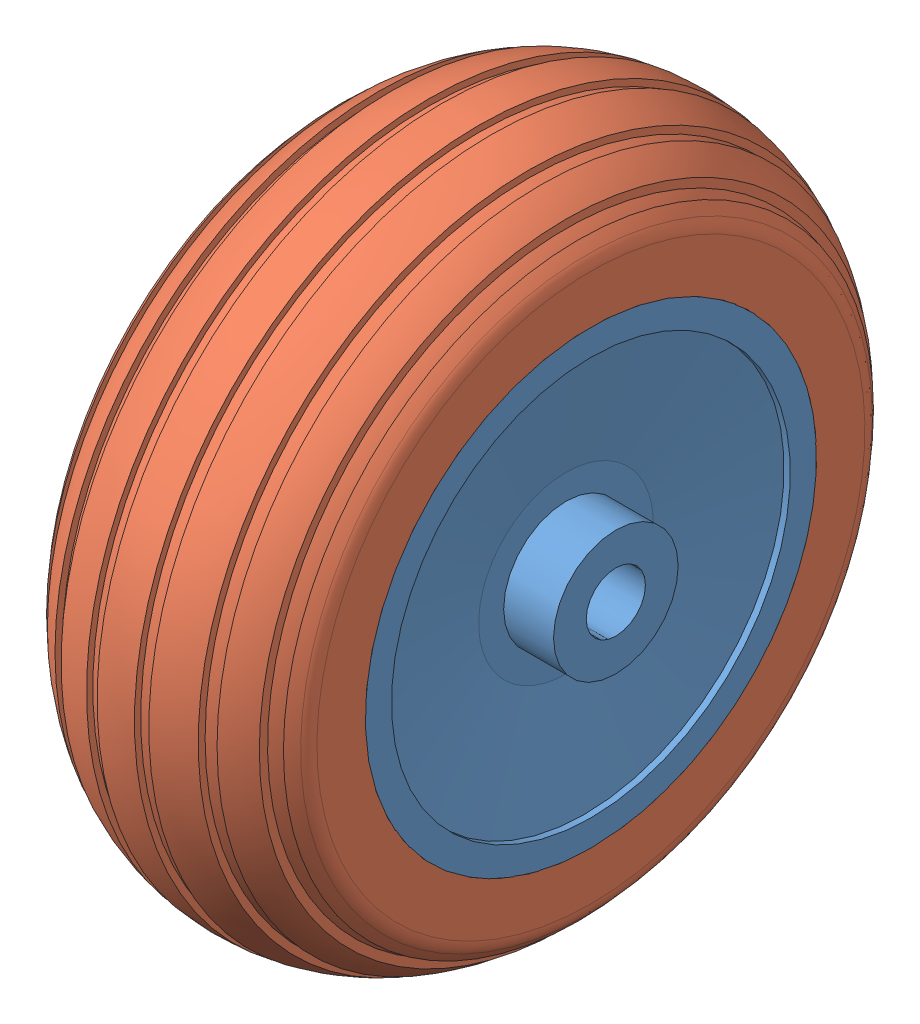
SolidWorks assembly Roulette.SLDASM, configuration Défaut (file format 9000). Lengths in mm.
Overall size (25 55.4 55.4).
2 component instances, 2 part files, 2 mates.
Components (placement in the parent):
- Roulette - Moyeu-1: Roulette - Moyeu.SLDPRT [Défaut] at origin size (25 36.2 36.2)
- Roulette - Bandage-1: Roulette - Bandage.SLDPRT [Défaut] at origin size (21 55.4 55.4)
Mates (geometry in assembly coordinates):
- Coaxiale1: concentric aligned: cylinder of Roulette - Moyeu-1 through (-61.4889 0 0) axis (-1 0 0) radius 18.1; cylinder of Roulette - Bandage-1 through (-61.4889 0 0) axis (-1 0 0) radius 18.1
- Coïncidente1: coincident anti-aligned: plane of Roulette - Moyeu-1 through (-2 12.9 0) normal (1 0 0); plane of Roulette - Bandage-1 through (-2 13.5 0) normal (-1 0 0)
